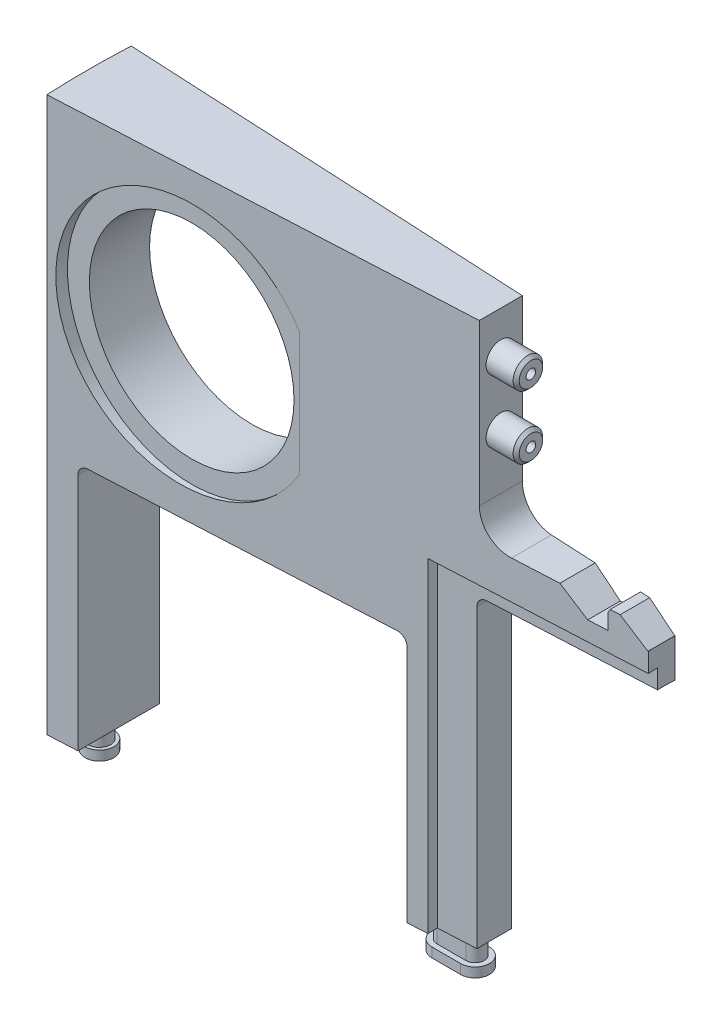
from build123d import *

# Parameters (mm, degrees)
REVOLVE1_ANGLE                     = 5.75
SKETCH2_W                          = 71.12
SKETCH2_H                          = 7.143345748
CUT_EXTRUDE1_DEPTH                 = 31.75
SKETCH3_R                          = 2.45
BOSS_EXTRUDE1_DEPTH                = 5
CUT_EXTRUDE2_DEPTH                 = 170.226918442
CUT_EXTRUDE2_DEPTH_BACK            = 170.226918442
SKETCH5_R                          = 17
FILLET1_R                          = 5.08
CUT_EXTRUDE3_DEPTH                 = 44.45
SKETCH13_W                         = 73.025
SKETCH13_H                         = 24.906710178
CUT_EXTRUDE6_DEPTH                 = 53.975
CUT_EXTRUDE4_DEPTH                 = 149.814741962
CUT_EXTRUDE4_DEPTH_BACK            = 12.7
SKETCH10_R                         = 76.486001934
SKETCH10_R_2                       = 1.8415
CUT_EXTRUDE5_DEPTH                 = 3.175
SKETCH11_R                         = 2.3876
BOSS_EXTRUDE4_DEPTH                = 1.5875
FILLET2_R                          = 1.5875
CUT_EXTRUDE7_DEPTH                 = 171.522022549
CUT_EXTRUDE7_DEPTH_BACK            = 171.522022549
SKETCH15_R                         = 20.6375
CUT_EXTRUDE8_DEPTH                 = 2.54
CHAMFER1_SIZE                      = 0.508
LPATTERN1_COUNT                    = 4
LPATTERN1_PITCH                    = 12.7
F_1_16_0_0625_DIAMETER_HOLE2_D     = 1.5875
F_1_16_0_0625_DIAMETER_HOLE2_DEPTH = 6.35
F_1_16_0_0625_DIAMETER_HOLE2_TIP   = 0.476933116


with BuildPart() as part:
    # Sketch1 → Revolve1 (revolve, symmetric)
    with BuildSketch(Plane.XY) as revolve1_sk:
        Polygon((-44.45, -95.25), (-139.7, -95.25), (-139.7, 0), (-82.55, 0), (-44.45, 0), align=None)
    revolve(axis=Axis((0, 0, 0), (0, 1, 0)), revolution_arc=REVOLVE1_ANGLE / 2)
    revolve(revolve1_sk.sketch, axis=Axis((0, 0, 0), (0, -1, 0)), revolution_arc=REVOLVE1_ANGLE / 2)

    # Sketch2 → Cut-Extrude1 (cut)
    with BuildSketch(Plane(origin=(0, 0, 0), x_dir=(1, 0, 0), z_dir=(0, 1, 0))):
        with Locations((-35.56, 0)):
            Rectangle(SKETCH2_W, SKETCH2_H)
    extrude(amount=-CUT_EXTRUDE1_DEPTH, mode=Mode.SUBTRACT)

    # Sketch3 → Boss-Extrude1 (add)
    with BuildSketch(Plane(origin=(-71.12, 0, 0), x_dir=(0, 0, -1), z_dir=(1, 0, 0))):
        with Locations(Location((0, -7, 0), (0, 0, 180))):
            Circle(SKETCH3_R)
        with Locations(Location((0, -17.5, 0), (0, 0, 180))):
            Circle(SKETCH3_R)
    extrude(amount=BOSS_EXTRUDE1_DEPTH)

    # Sketch5 → Cut-Extrude2 (cut, two sides: drawn at the far end of the back side and taken through both)
    with BuildSketch(Plane.XY.offset(-CUT_EXTRUDE2_DEPTH_BACK)):
        with Locations((-117.475, -25.4)):
            Circle(SKETCH5_R)
    extrude(amount=CUT_EXTRUDE2_DEPTH + CUT_EXTRUDE2_DEPTH_BACK, mode=Mode.SUBTRACT)

    # Fillet1
    fillet1_edges = [part.edges().sort_by_distance(p)[0] for p in [
        (-71.12, -31.75, 0),
    ]]
    fillet(fillet1_edges, radius=FILLET1_R)

    # Sketch6 → Cut-Extrude3 (cut)
    with BuildSketch(Plane.XZ.offset(95.25)):
        Polygon((-82.55, -4.145691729), (-134.62, -6.760666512), (-134.62, 6.760666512), (-82.55, 4.145691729), align=None)
    extrude(amount=-CUT_EXTRUDE3_DEPTH, mode=Mode.SUBTRACT)

    # Sketch13 → Cut-Extrude6 (cut)
    with BuildSketch(Plane.XZ.offset(95.25)):
        with Locations((-36.5125, 0)):
            Rectangle(SKETCH13_W, SKETCH13_H)
    extrude(amount=-CUT_EXTRUDE6_DEPTH, mode=Mode.SUBTRACT)

    # Sketch9 → Cut-Extrude4 (cut, two sides: drawn at the far end of the back side and taken through both)
    with BuildSketch(Plane.XZ.offset(50.8).offset(-CUT_EXTRUDE4_DEPTH_BACK)):
        Polygon((-34.88104121, 1.751738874), (-34.88104121, 0.162238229), (-79.27509366, 2.391724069), (-79.27509366, 3.981224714), align=None)
    extrude(amount=CUT_EXTRUDE4_DEPTH + CUT_EXTRUDE4_DEPTH_BACK, mode=Mode.SUBTRACT)

    # Sketch10 → Cut-Extrude5 (cut)
    with BuildSketch(Plane.XZ.offset(95.25)):
        with Locations((-134.62, 0)):
            Circle(SKETCH10_R)
        with Locations(Location((-137.795, 0, 0), (0, 0, 270))):
            Circle(SKETCH10_R_2, mode=Mode.SUBTRACT)
        with BuildLine():
            Line((-80.1751, 1.524), (-75.3999, 1.524))
            ThreePointArc((-75.3999, 1.524), (-73.8759, 0), (-75.3999, -1.524))
            Line((-75.3999, -1.524), (-80.1751, -1.524))
            ThreePointArc((-80.1751, -1.524), (-81.6991, 0), (-80.1751, 1.524))
        make_face(mode=Mode.SUBTRACT)
    extrude(amount=-CUT_EXTRUDE5_DEPTH, mode=Mode.SUBTRACT)

    # Sketch11 → Boss-Extrude4 (add)
    with BuildSketch(Plane.XZ.offset(95.25)):
        with Locations(Location((-137.795, 0, 0), (0, 0, 270))):
            Circle(SKETCH11_R)
        with BuildLine():
            Line((-80.1751, 2.3876), (-75.3999, 2.3876))
            ThreePointArc((-75.3999, 2.3876), (-73.0123, 0), (-75.3999, -2.3876))
            Line((-75.3999, -2.3876), (-80.1751, -2.3876))
            ThreePointArc((-80.1751, -2.3876), (-82.5627, 0), (-80.1751, 2.3876))
        make_face()
    extrude(amount=BOSS_EXTRUDE4_DEPTH)

    # Fillet2
    fillet2_edges = [part.edges().sort_by_distance(p)[0] for p in [
        (-82.55, -50.8, 0),
        (-134.62, -50.8, 0),
        (-73.025, -41.275, -0.794750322),
    ]]
    fillet(fillet2_edges, radius=FILLET2_R)

    # Sketch14 → Cut-Extrude7 (cut, two sides: drawn at the far end of the back side and taken through both)
    with BuildSketch(Plane.XY.offset(-CUT_EXTRUDE7_DEPTH_BACK)):
        Polygon((-50.433382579, -31.75), (-53.975, -31.75), (-58.370882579, -31.75), (-53.975, -34.925), (-50.8, -34.925), (-50.8, -32.385), align=None)
        Polygon((-48.845882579, -31.75), (-44.45, -34.925), (-31.576203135, -34.925), (-31.576203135, -31.75), (-44.45, -31.75), align=None)
    extrude(amount=CUT_EXTRUDE7_DEPTH + CUT_EXTRUDE7_DEPTH_BACK, mode=Mode.SUBTRACT)

    # Sketch15 → Cut-Extrude8 (cut)
    with BuildSketch(Plane.XY.offset(5)):
        with Locations((-117.475, -25.4)):
            Circle(SKETCH15_R)
    cut_extrude8 = extrude(amount=CUT_EXTRUDE8_DEPTH, mode=Mode.SUBTRACT)

    # Mirror1: Cut-Extrude8 across plane
    add(cut_extrude8.mirror(Plane.XY), mode=Mode.SUBTRACT)

    # Chamfer1
    chamfer1_edges = [part.edges().sort_by_distance(p)[0] for p in [
        (-66.12, -7, -2.45),
        (-66.12, -17.5, -2.45),
    ]]
    chamfer(chamfer1_edges, length=CHAMFER1_SIZE)

    # Sketch16 → 1_16 _0.0625_ Diameter Hole1 (revolve, cut)
    with BuildSketch(Plane(origin=(-127, -50.8, 0), x_dir=(0, 0, -1), z_dir=(1, 0, 0))):
        Polygon((0, 0), (0, 6.826933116), (0.79375, 6.35), (0.79375, 0), align=None)
    f_1_16_0_0625_diameter_hole1 = revolve(axis=Axis((-127, -57.15, 0), (0, 1, 0)), mode=Mode.SUBTRACT)

    # Sketch18 → 1_8 _0.125_ Diameter Hole1 (revolve, cut)
    with BuildSketch(Plane(origin=(-127, -50.8, 0), x_dir=(0, 0, -1), z_dir=(1, 0, 0))):
        Polygon((0, 0), (0, 2.223866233), (1.5875, 1.27), (1.5875, 0), align=None)
    f_1_8_0_125_diameter_hole1 = revolve(axis=Axis((-127, -57.15, 0), (0, 1, 0)), mode=Mode.SUBTRACT)

    # LPattern1: 1_16 _0.0625_ Diameter Hole1, 1_8 _0.125_ Diameter Hole1 ×4
    with Locations(*[(i * LPATTERN1_PITCH, 0, 0) for i in range(1, LPATTERN1_COUNT)]):
        add(f_1_16_0_0625_diameter_hole1, mode=Mode.SUBTRACT)
        add(f_1_8_0_125_diameter_hole1, mode=Mode.SUBTRACT)

    # 1_16 _0.0625_ Diameter Hole2
    with Locations(Plane(origin=(-66.12, 0, 0), x_dir=(0, 0, -1), z_dir=(1, 0, 0))):
        with Locations((0, -7), (0, -17.5)):
            Hole(F_1_16_0_0625_DIAMETER_HOLE2_D / 2, depth=F_1_16_0_0625_DIAMETER_HOLE2_DEPTH)
            with Locations((0, 0, -(F_1_16_0_0625_DIAMETER_HOLE2_DEPTH + F_1_16_0_0625_DIAMETER_HOLE2_TIP / 2))):  # 118° drill point
                Cone(0, F_1_16_0_0625_DIAMETER_HOLE2_D / 2, F_1_16_0_0625_DIAMETER_HOLE2_TIP, mode=Mode.SUBTRACT)


solid = part.part
